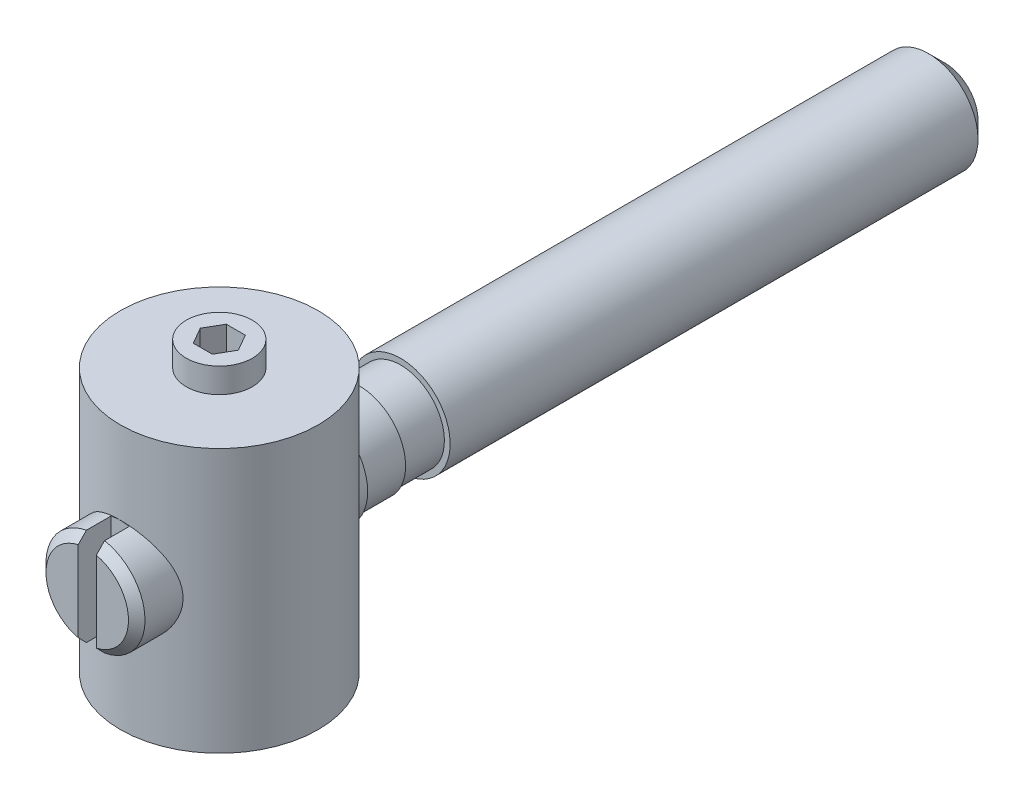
ISO-10303-21;
HEADER;
FILE_DESCRIPTION(('STEP AP214'),'2;1');
FILE_NAME('part.step','',(''),(''),'','','');
FILE_SCHEMA(('AUTOMOTIVE_DESIGN { 1 0 10303 214 1 1 1 1 }'));
ENDSEC;
DATA;
#1=APPLICATION_CONTEXT('core data for automotive mechanical design processes');
#2=APPLICATION_PROTOCOL_DEFINITION('international standard','automotive_design',2000,#1);
#3=PRODUCT_CONTEXT('',#1,'mechanical');
#4=PRODUCT('Part','Part','',(#3));
#5=PRODUCT_RELATED_PRODUCT_CATEGORY('part','',(#4));
#6=PRODUCT_DEFINITION_FORMATION('','',#4);
#7=PRODUCT_DEFINITION_CONTEXT('part definition',#1,'design');
#8=PRODUCT_DEFINITION('design','',#6,#7);
#9=PRODUCT_DEFINITION_SHAPE('','',#8);
#10=(LENGTH_UNIT() NAMED_UNIT(*) SI_UNIT(.MILLI.,.METRE.));
#11=(NAMED_UNIT(*) PLANE_ANGLE_UNIT() SI_UNIT($,.RADIAN.));
#12=(NAMED_UNIT(*) SI_UNIT($,.STERADIAN.) SOLID_ANGLE_UNIT());
#13=UNCERTAINTY_MEASURE_WITH_UNIT(LENGTH_MEASURE(1.E-05),#10,'distance_accuracy_value','');
#14=(GEOMETRIC_REPRESENTATION_CONTEXT(3) GLOBAL_UNCERTAINTY_ASSIGNED_CONTEXT((#13)) GLOBAL_UNIT_ASSIGNED_CONTEXT((#10,
#11,#12)) REPRESENTATION_CONTEXT('',''));
#15=CARTESIAN_POINT('',(0.,0.,0.));
#16=DIRECTION('',(0.,0.,1.));
#17=DIRECTION('',(1.,0.,0.));
#18=AXIS2_PLACEMENT_3D('',#15,#16,#17);
#19=CARTESIAN_POINT('',(0.,0.,8.0051873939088));
#20=DIRECTION('',(0.,0.,-1.));
#21=DIRECTION('',(0.,1.,0.));
#22=AXIS2_PLACEMENT_3D('',#19,#20,#21);
#23=PLANE('',#22);
#24=CARTESIAN_POINT('',(0.,0.,8.0051873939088));
#25=DIRECTION('',(0.,0.,-1.));
#26=DIRECTION('',(0.,1.,0.));
#27=AXIS2_PLACEMENT_3D('',#24,#25,#26);
#28=CIRCLE('',#27,2.5);
#29=CARTESIAN_POINT('',(0.55,-2.43874967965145,8.0051873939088));
#30=VERTEX_POINT('',#29);
#31=CARTESIAN_POINT('',(0.55,2.43874967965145,8.0051873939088));
#32=VERTEX_POINT('',#31);
#33=EDGE_CURVE('E661',#30,#32,#28,.F.);
#34=ORIENTED_EDGE('',*,*,#33,.T.);
#35=DIRECTION('',(0.,1.,0.));
#36=VECTOR('',#35,1.);
#37=CARTESIAN_POINT('',(0.55,2.94915242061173,8.0051873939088));
#38=LINE('',#37,#36);
#39=EDGE_CURVE('E339',#30,#32,#38,.T.);
#40=ORIENTED_EDGE('',*,*,#39,.F.);
#41=EDGE_LOOP('',(#34,#40));
#42=FACE_BOUND('',#41,.T.);
#43=ADVANCED_FACE('F14',(#42),#23,.F.);
#44=CARTESIAN_POINT('',(-0.55,2.43874967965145,8.0051873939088));
#45=VERTEX_POINT('',#44);
#46=CARTESIAN_POINT('',(-0.55,-2.43874967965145,8.0051873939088));
#47=VERTEX_POINT('',#46);
#48=EDGE_CURVE('E657',#45,#47,#28,.F.);
#49=ORIENTED_EDGE('',*,*,#48,.T.);
#50=DIRECTION('',(0.,-1.,0.));
#51=VECTOR('',#50,1.);
#52=CARTESIAN_POINT('',(-0.55,2.94915242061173,8.0051873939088));
#53=LINE('',#52,#51);
#54=EDGE_CURVE('E324',#45,#47,#53,.T.);
#55=ORIENTED_EDGE('',*,*,#54,.F.);
#56=EDGE_LOOP('',(#49,#55));
#57=FACE_BOUND('',#56,.T.);
#58=ADVANCED_FACE('F232',(#57),#23,.F.);
#59=CARTESIAN_POINT('',(0.,0.,8.0051873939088));
#60=DIRECTION('',(0.,0.,-1.));
#61=DIRECTION('',(0.,1.,0.));
#62=AXIS2_PLACEMENT_3D('',#59,#60,#61);
#63=CONICAL_SURFACE('',#62,2.5,0.785398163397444);
#64=CARTESIAN_POINT('',(0.55,-6.50102808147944,3.9809352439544));
#65=CARTESIAN_POINT('',(0.550000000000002,-6.26878430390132,4.21234487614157));
#66=CARTESIAN_POINT('',(0.550000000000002,-6.03650345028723,4.44371734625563));
#67=CARTESIAN_POINT('',(0.550000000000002,-5.57180325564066,4.90634935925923));
#68=CARTESIAN_POINT('',(0.550000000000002,-5.33938390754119,5.13760889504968));
#69=CARTESIAN_POINT('',(0.550000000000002,-4.87405391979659,5.60026316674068));
#70=CARTESIAN_POINT('',(0.550000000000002,-4.64114304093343,5.83165766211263));
#71=CARTESIAN_POINT('',(0.550000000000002,-4.17505880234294,6.29415664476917));
#72=CARTESIAN_POINT('',(0.550000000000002,-3.94188545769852,6.52526114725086));
#73=CARTESIAN_POINT('',(0.550000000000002,-3.48876050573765,6.97348944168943));
#74=CARTESIAN_POINT('',(0.550000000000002,-3.2688345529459,7.19063914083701));
#75=CARTESIAN_POINT('',(0.550000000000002,-2.93838672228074,7.51583248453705));
#76=CARTESIAN_POINT('',(0.550000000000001,-2.82813513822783,7.62415068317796));
#77=CARTESIAN_POINT('',(0.550000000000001,-2.60737712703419,7.84052364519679));
#78=CARTESIAN_POINT('',(0.550000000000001,-2.49687070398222,7.94857841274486));
#79=CARTESIAN_POINT('',(0.550000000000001,-2.27557596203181,8.16422073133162));
#80=CARTESIAN_POINT('',(0.550000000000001,-2.16478794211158,8.27180858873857));
#81=CARTESIAN_POINT('',(0.550000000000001,-1.94263422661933,8.48640006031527));
#82=CARTESIAN_POINT('',(0.550000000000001,-1.83126849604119,8.59340363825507));
#83=CARTESIAN_POINT('',(0.550000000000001,-1.60764395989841,8.80641455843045));
#84=CARTESIAN_POINT('',(0.550000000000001,-1.49538542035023,8.91242217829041));
#85=CARTESIAN_POINT('',(0.550000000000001,-1.32572231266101,9.07005149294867));
#86=CARTESIAN_POINT('',(0.550000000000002,-1.26895825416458,9.12236167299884));
#87=CARTESIAN_POINT('',(0.550000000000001,-1.15481596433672,9.22630662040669));
#88=CARTESIAN_POINT('',(0.55,-1.09743775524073,9.27794141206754));
#89=CARTESIAN_POINT('',(0.55,-1.00730091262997,9.35761177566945));
#90=CARTESIAN_POINT('',(0.550000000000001,-0.974856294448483,9.38600225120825));
#91=CARTESIAN_POINT('',(0.550000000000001,-0.909597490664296,9.44236289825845));
#92=CARTESIAN_POINT('',(0.550000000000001,-0.876783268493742,9.47033302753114));
#93=CARTESIAN_POINT('',(0.550000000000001,-0.810349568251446,9.52598685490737));
#94=CARTESIAN_POINT('',(0.550000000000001,-0.776725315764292,9.55366487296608));
#95=CARTESIAN_POINT('',(0.550000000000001,-0.708843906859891,9.60821974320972));
#96=CARTESIAN_POINT('',(0.55,-0.674586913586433,9.63509679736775));
#97=CARTESIAN_POINT('',(0.55,-0.604824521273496,9.68800399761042));
#98=CARTESIAN_POINT('',(0.550000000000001,-0.569309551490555,9.71402162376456));
#99=CARTESIAN_POINT('',(0.550000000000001,-0.497005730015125,9.76435177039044));
#100=CARTESIAN_POINT('',(0.550000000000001,-0.460215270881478,9.78866201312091));
#101=CARTESIAN_POINT('',(0.550000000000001,-0.385289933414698,9.83431268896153));
#102=CARTESIAN_POINT('',(0.550000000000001,-0.34717164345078,9.85567974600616));
#103=CARTESIAN_POINT('',(0.550000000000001,-0.268817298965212,9.89396414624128));
#104=CARTESIAN_POINT('',(0.55,-0.228588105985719,9.91089495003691));
#105=CARTESIAN_POINT('',(0.55,-0.149262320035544,9.93640009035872));
#106=CARTESIAN_POINT('',(0.550000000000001,-0.110374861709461,9.94557620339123));
#107=CARTESIAN_POINT('',(0.550000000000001,-0.0513606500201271,9.95314112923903));
#108=CARTESIAN_POINT('',(0.550000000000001,-0.0316215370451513,9.95463319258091));
#109=CARTESIAN_POINT('',(0.550000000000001,0.00790124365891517,9.95548587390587));
#110=CARTESIAN_POINT('',(0.55,0.0276849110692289,9.95484650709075));
#111=CARTESIAN_POINT('',(0.55,0.0865984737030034,9.94977291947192));
#112=CARTESIAN_POINT('',(0.550000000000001,0.125485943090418,9.94220777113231));
#113=CARTESIAN_POINT('',(0.550000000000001,0.182445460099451,9.92601337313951));
#114=CARTESIAN_POINT('',(0.550000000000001,0.201280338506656,9.9197704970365));
#115=CARTESIAN_POINT('',(0.55,0.238462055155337,9.90596368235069));
#116=CARTESIAN_POINT('',(0.55,0.256808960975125,9.89839992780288));
#117=CARTESIAN_POINT('',(0.55,0.305948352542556,9.87643510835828));
#118=CARTESIAN_POINT('',(0.55,0.336277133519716,9.86100721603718));
#119=CARTESIAN_POINT('',(0.550000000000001,0.395777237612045,9.82804111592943));
#120=CARTESIAN_POINT('',(0.550000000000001,0.424947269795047,9.81050063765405));
#121=CARTESIAN_POINT('',(0.550000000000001,0.482451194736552,9.77391062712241));
#122=CARTESIAN_POINT('',(0.550000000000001,0.510782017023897,9.75485631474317));
#123=CARTESIAN_POINT('',(0.550000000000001,0.566720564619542,9.71570945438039));
#124=CARTESIAN_POINT('',(0.550000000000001,0.594328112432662,9.69561665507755));
#125=CARTESIAN_POINT('',(0.550000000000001,0.676801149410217,9.63386089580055));
#126=CARTESIAN_POINT('',(0.550000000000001,0.730809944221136,9.59105876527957));
#127=CARTESIAN_POINT('',(0.55,0.837297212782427,9.50386307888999));
#128=CARTESIAN_POINT('',(0.55,0.889778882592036,9.45947335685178));
#129=CARTESIAN_POINT('',(0.55,0.992705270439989,9.37059267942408));
#130=CARTESIAN_POINT('',(0.55,1.04316953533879,9.32612430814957));
#131=CARTESIAN_POINT('',(0.550000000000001,1.14348661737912,9.2365035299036));
#132=CARTESIAN_POINT('',(0.55,1.19333941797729,9.19135110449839));
#133=CARTESIAN_POINT('',(0.55,1.34226503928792,9.05517405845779));
#134=CARTESIAN_POINT('',(0.55,1.44069043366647,8.96344255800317));
#135=CARTESIAN_POINT('',(0.55,1.63669733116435,8.77885702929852));
#136=CARTESIAN_POINT('',(0.55,1.73427769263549,8.68600179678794));
#137=CARTESIAN_POINT('',(0.55,1.92882854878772,8.49967073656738));
#138=CARTESIAN_POINT('',(0.55,2.02579909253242,8.40619496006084));
#139=CARTESIAN_POINT('',(0.55,2.2184603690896,8.21969145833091));
#140=CARTESIAN_POINT('',(0.55,2.31415469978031,8.12666744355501));
#141=CARTESIAN_POINT('',(0.55,2.5052737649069,7.94033898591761));
#142=CARTESIAN_POINT('',(0.55,2.6006984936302,7.84703453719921));
#143=CARTESIAN_POINT('',(0.55,2.88659462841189,7.56691205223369));
#144=CARTESIAN_POINT('',(0.55,3.07677660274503,7.3797987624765));
#145=CARTESIAN_POINT('',(0.55,3.53573885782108,6.92720423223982));
#146=CARTESIAN_POINT('',(0.55,3.80430289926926,6.66150397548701));
#147=CARTESIAN_POINT('',(0.55,4.34102523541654,6.12960257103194));
#148=CARTESIAN_POINT('',(0.55,4.60918345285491,5.8634013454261));
#149=CARTESIAN_POINT('',(0.549999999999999,5.14808057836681,5.3279001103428));
#150=CARTESIAN_POINT('',(0.549999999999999,5.41881663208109,5.05859722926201));
#151=CARTESIAN_POINT('',(0.549999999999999,5.96005951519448,4.51985635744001));
#152=CARTESIAN_POINT('',(0.549999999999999,6.23056637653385,4.25041839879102));
#153=CARTESIAN_POINT('',(0.55,6.50102808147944,3.9809352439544));
#154=B_SPLINE_CURVE_WITH_KNOTS('',3,(#64,#65,#66,#67,#68,#69,#70,#71,#72,#73,#74,#75,#76,#77,
#78,#79,#80,#81,#82,#83,#84,#85,#86,#87,#88,#89,#90,#91,#92,#93,#94,#95,#96,#97,#98,#99,#100,
#101,#102,#103,#104,#105,#106,#107,#108,#109,#110,#111,#112,#113,#114,#115,#116,#117,#118,#119,
#120,#121,#122,#123,#124,#125,#126,#127,#128,#129,#130,#131,#132,#133,#134,#135,#136,#137,#138,
#139,#140,#141,#142,#143,#144,#145,#146,#147,#148,#149,#150,#151,#152,#153),.UNSPECIFIED.,.F.,
.F.,(4,2,2,2,2,2,2,2,2,2,2,2,2,2,2,2,2,2,2,2,2,2,2,2,2,2,2,2,2,2,2,2,2,2,2,2,2,2,2,2,2,2,2,2,4),
(0.,0.98355904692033,1.9671735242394,2.95211904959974,3.93701060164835,4.86420563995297,
5.32787999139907,5.79154695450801,6.25484022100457,6.71816189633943,7.18135034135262,
7.41292148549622,7.64448427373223,7.77381859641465,7.9031658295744,8.03380939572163,
8.16441973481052,8.29646240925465,8.42867801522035,8.55960561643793,8.69013122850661,
8.80923071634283,8.86850869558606,8.92778625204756,9.04576418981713,9.10526044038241,
9.16474840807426,9.26669637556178,9.36875490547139,9.47114958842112,9.57356916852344,
9.78023388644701,9.98642938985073,10.1882031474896,10.3899823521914,10.7935992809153,
11.1976957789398,11.601759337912,12.0021308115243,12.4025107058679,13.2028997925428,
14.3362608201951,15.4698157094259,16.6154152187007,17.7608132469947),.UNSPECIFIED.);
#155=CARTESIAN_POINT('',(0.55,-2.94915242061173,7.5051873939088));
#156=VERTEX_POINT('',#155);
#157=EDGE_CURVE('E254',#156,#30,#154,.T.);
#158=ORIENTED_EDGE('',*,*,#157,.F.);
#159=CARTESIAN_POINT('',(0.,0.,7.5051873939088));
#160=DIRECTION('',(0.,0.,-1.));
#161=DIRECTION('',(0.,1.,0.));
#162=AXIS2_PLACEMENT_3D('',#159,#160,#161);
#163=CIRCLE('',#162,3.);
#164=CARTESIAN_POINT('',(0.55,2.94915242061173,7.5051873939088));
#165=VERTEX_POINT('',#164);
#166=EDGE_CURVE('E663',#165,#156,#163,.T.);
#167=ORIENTED_EDGE('',*,*,#166,.F.);
#168=EDGE_CURVE('E238',#32,#165,#154,.T.);
#169=ORIENTED_EDGE('',*,*,#168,.F.);
#170=ORIENTED_EDGE('',*,*,#33,.F.);
#171=EDGE_LOOP('',(#158,#167,#169,#170));
#172=FACE_BOUND('',#171,.T.);
#173=ADVANCED_FACE('F227',(#172),#63,.T.);
#174=CARTESIAN_POINT('',(0.55,2.94915242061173,6.0051873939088));
#175=DIRECTION('',(1.,0.,0.));
#176=DIRECTION('',(0.,1.,0.));
#177=AXIS2_PLACEMENT_3D('',#174,#175,#176);
#178=PLANE('',#177);
#179=ORIENTED_EDGE('',*,*,#157,.T.);
#180=ORIENTED_EDGE('',*,*,#39,.T.);
#181=ORIENTED_EDGE('',*,*,#168,.T.);
#182=DIRECTION('',(0.,0.,1.));
#183=VECTOR('',#182,1.);
#184=CARTESIAN_POINT('',(0.55,2.94915242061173,6.0051873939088));
#185=LINE('',#184,#183);
#186=CARTESIAN_POINT('',(0.55,2.94915242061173,6.0051873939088));
#187=VERTEX_POINT('',#186);
#188=EDGE_CURVE('E321',#187,#165,#185,.T.);
#189=ORIENTED_EDGE('',*,*,#188,.F.);
#190=DIRECTION('',(0.,1.,0.));
#191=VECTOR('',#190,1.);
#192=CARTESIAN_POINT('',(0.55,2.94915242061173,6.0051873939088));
#193=LINE('',#192,#191);
#194=CARTESIAN_POINT('',(0.55,-2.94915242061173,6.0051873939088));
#195=VERTEX_POINT('',#194);
#196=EDGE_CURVE('E89',#195,#187,#193,.T.);
#197=ORIENTED_EDGE('',*,*,#196,.F.);
#198=DIRECTION('',(0.,0.,1.));
#199=VECTOR('',#198,1.);
#200=CARTESIAN_POINT('',(0.55,-2.94915242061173,6.0051873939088));
#201=LINE('',#200,#199);
#202=EDGE_CURVE('E328',#195,#156,#201,.T.);
#203=ORIENTED_EDGE('',*,*,#202,.T.);
#204=EDGE_LOOP('',(#179,#180,#181,#189,#197,#203));
#205=FACE_BOUND('',#204,.T.);
#206=ADVANCED_FACE('F231',(#205),#178,.F.);
#207=CARTESIAN_POINT('',(0.,0.,6.0051873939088));
#208=DIRECTION('',(0.,0.,1.));
#209=DIRECTION('',(0.,-1.,0.));
#210=AXIS2_PLACEMENT_3D('',#207,#208,#209);
#211=PLANE('',#210);
#212=CARTESIAN_POINT('',(0.,0.,6.0051873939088));
#213=DIRECTION('',(0.,0.,1.));
#214=DIRECTION('',(0.,-1.,0.));
#215=AXIS2_PLACEMENT_3D('',#212,#213,#214);
#216=CIRCLE('',#215,3.);
#217=CARTESIAN_POINT('',(-0.55,-2.94915242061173,6.0051873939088));
#218=VERTEX_POINT('',#217);
#219=EDGE_CURVE('E343',#218,#195,#216,.T.);
#220=ORIENTED_EDGE('',*,*,#219,.T.);
#221=ORIENTED_EDGE('',*,*,#196,.T.);
#222=CARTESIAN_POINT('',(0.,0.,6.0051873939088));
#223=DIRECTION('',(0.,0.,1.));
#224=DIRECTION('',(0.,-1.,0.));
#225=AXIS2_PLACEMENT_3D('',#222,#223,#224);
#226=CIRCLE('',#225,3.);
#227=CARTESIAN_POINT('',(-0.55,2.94915242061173,6.0051873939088));
#228=VERTEX_POINT('',#227);
#229=EDGE_CURVE('E333',#187,#228,#226,.T.);
#230=ORIENTED_EDGE('',*,*,#229,.T.);
#231=DIRECTION('',(0.,-1.,0.));
#232=VECTOR('',#231,1.);
#233=CARTESIAN_POINT('',(-0.55,2.94915242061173,6.0051873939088));
#234=LINE('',#233,#232);
#235=EDGE_CURVE('E329',#228,#218,#234,.T.);
#236=ORIENTED_EDGE('',*,*,#235,.T.);
#237=EDGE_LOOP('',(#220,#221,#230,#236));
#238=FACE_BOUND('',#237,.T.);
#239=ADVANCED_FACE('F264',(#238),#211,.T.);
#240=CARTESIAN_POINT('',(-0.55,2.94915242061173,6.0051873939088));
#241=DIRECTION('',(-1.,0.,0.));
#242=DIRECTION('',(0.,-1.,0.));
#243=AXIS2_PLACEMENT_3D('',#240,#241,#242);
#244=PLANE('',#243);
#245=CARTESIAN_POINT('',(-0.55,6.50102808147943,3.9809352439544));
#246=CARTESIAN_POINT('',(-0.55,6.26878430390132,4.21234487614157));
#247=CARTESIAN_POINT('',(-0.55,6.03650345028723,4.44371734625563));
#248=CARTESIAN_POINT('',(-0.55,5.57180325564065,4.90634935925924));
#249=CARTESIAN_POINT('',(-0.55,5.33938390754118,5.13760889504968));
#250=CARTESIAN_POINT('',(-0.55,4.87405391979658,5.60026316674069));
#251=CARTESIAN_POINT('',(-0.55,4.64114304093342,5.83165766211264));
#252=CARTESIAN_POINT('',(-0.55,4.17505880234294,6.29415664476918));
#253=CARTESIAN_POINT('',(-0.55,3.94188545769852,6.52526114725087));
#254=CARTESIAN_POINT('',(-0.55,3.48876050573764,6.97348944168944));
#255=CARTESIAN_POINT('',(-0.55,3.26883455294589,7.19063914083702));
#256=CARTESIAN_POINT('',(-0.55,2.93838672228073,7.51583248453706));
#257=CARTESIAN_POINT('',(-0.55,2.82813513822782,7.62415068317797));
#258=CARTESIAN_POINT('',(-0.55,2.60737712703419,7.84052364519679));
#259=CARTESIAN_POINT('',(-0.55,2.49687070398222,7.94857841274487));
#260=CARTESIAN_POINT('',(-0.55,2.27557596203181,8.16422073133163));
#261=CARTESIAN_POINT('',(-0.55,2.16478794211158,8.27180858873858));
#262=CARTESIAN_POINT('',(-0.55,1.94263422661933,8.48640006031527));
#263=CARTESIAN_POINT('',(-0.55,1.83126849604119,8.59340363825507));
#264=CARTESIAN_POINT('',(-0.55,1.60764395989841,8.80641455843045));
#265=CARTESIAN_POINT('',(-0.55,1.49538542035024,8.91242217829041));
#266=CARTESIAN_POINT('',(-0.55,1.32572231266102,9.07005149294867));
#267=CARTESIAN_POINT('',(-0.55,1.26895825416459,9.12236167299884));
#268=CARTESIAN_POINT('',(-0.55,1.15481596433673,9.22630662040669));
#269=CARTESIAN_POINT('',(-0.55,1.09743775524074,9.27794141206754));
#270=CARTESIAN_POINT('',(-0.55,1.00730091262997,9.35761177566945));
#271=CARTESIAN_POINT('',(-0.55,0.974856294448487,9.38600225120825));
#272=CARTESIAN_POINT('',(-0.55,0.9095974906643,9.44236289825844));
#273=CARTESIAN_POINT('',(-0.55,0.876783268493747,9.47033302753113));
#274=CARTESIAN_POINT('',(-0.55,0.81034956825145,9.52598685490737));
#275=CARTESIAN_POINT('',(-0.55,0.776725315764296,9.55366487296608));
#276=CARTESIAN_POINT('',(-0.55,0.708843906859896,9.60821974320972));
#277=CARTESIAN_POINT('',(-0.55,0.674586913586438,9.63509679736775));
#278=CARTESIAN_POINT('',(-0.55,0.6048245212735,9.68800399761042));
#279=CARTESIAN_POINT('',(-0.55,0.569309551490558,9.71402162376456));
#280=CARTESIAN_POINT('',(-0.55,0.497005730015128,9.76435177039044));
#281=CARTESIAN_POINT('',(-0.55,0.460215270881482,9.78866201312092));
#282=CARTESIAN_POINT('',(-0.55,0.385289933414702,9.83431268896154));
#283=CARTESIAN_POINT('',(-0.55,0.347171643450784,9.85567974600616));
#284=CARTESIAN_POINT('',(-0.55,0.268817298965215,9.89396414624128));
#285=CARTESIAN_POINT('',(-0.55,0.228588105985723,9.91089495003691));
#286=CARTESIAN_POINT('',(-0.55,0.149262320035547,9.93640009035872));
#287=CARTESIAN_POINT('',(-0.55,0.110374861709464,9.94557620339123));
#288=CARTESIAN_POINT('',(-0.55,0.0513606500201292,9.95314112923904));
#289=CARTESIAN_POINT('',(-0.55,0.0316215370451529,9.95463319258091));
#290=CARTESIAN_POINT('',(-0.55,-0.00790124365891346,9.95548587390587));
#291=CARTESIAN_POINT('',(-0.55,-0.0276849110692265,9.95484650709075));
#292=CARTESIAN_POINT('',(-0.55,-0.0865984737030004,9.94977291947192));
#293=CARTESIAN_POINT('',(-0.55,-0.125485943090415,9.94220777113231));
#294=CARTESIAN_POINT('',(-0.55,-0.182445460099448,9.92601337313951));
#295=CARTESIAN_POINT('',(-0.55,-0.201280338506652,9.91977049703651));
#296=CARTESIAN_POINT('',(-0.55,-0.238462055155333,9.90596368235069));
#297=CARTESIAN_POINT('',(-0.55,-0.256808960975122,9.89839992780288));
#298=CARTESIAN_POINT('',(-0.55,-0.305948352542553,9.87643510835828));
#299=CARTESIAN_POINT('',(-0.55,-0.336277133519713,9.86100721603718));
#300=CARTESIAN_POINT('',(-0.55,-0.395777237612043,9.82804111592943));
#301=CARTESIAN_POINT('',(-0.55,-0.424947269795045,9.81050063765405));
#302=CARTESIAN_POINT('',(-0.55,-0.48245119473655,9.77391062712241));
#303=CARTESIAN_POINT('',(-0.55,-0.510782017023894,9.75485631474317));
#304=CARTESIAN_POINT('',(-0.55,-0.566720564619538,9.7157094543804));
#305=CARTESIAN_POINT('',(-0.55,-0.59432811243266,9.69561665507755));
#306=CARTESIAN_POINT('',(-0.55,-0.676801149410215,9.63386089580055));
#307=CARTESIAN_POINT('',(-0.55,-0.730809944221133,9.59105876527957));
#308=CARTESIAN_POINT('',(-0.55,-0.837297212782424,9.50386307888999));
#309=CARTESIAN_POINT('',(-0.55,-0.889778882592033,9.45947335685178));
#310=CARTESIAN_POINT('',(-0.55,-0.992705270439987,9.37059267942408));
#311=CARTESIAN_POINT('',(-0.55,-1.04316953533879,9.32612430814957));
#312=CARTESIAN_POINT('',(-0.55,-1.14348661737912,9.2365035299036));
#313=CARTESIAN_POINT('',(-0.55,-1.19333941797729,9.19135110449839));
#314=CARTESIAN_POINT('',(-0.55,-1.34226503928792,9.05517405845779));
#315=CARTESIAN_POINT('',(-0.55,-1.44069043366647,8.96344255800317));
#316=CARTESIAN_POINT('',(-0.55,-1.63669733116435,8.77885702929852));
#317=CARTESIAN_POINT('',(-0.55,-1.73427769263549,8.68600179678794));
#318=CARTESIAN_POINT('',(-0.55,-1.92882854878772,8.49967073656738));
#319=CARTESIAN_POINT('',(-0.55,-2.02579909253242,8.40619496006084));
#320=CARTESIAN_POINT('',(-0.55,-2.2184603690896,8.21969145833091));
#321=CARTESIAN_POINT('',(-0.55,-2.31415469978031,8.12666744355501));
#322=CARTESIAN_POINT('',(-0.55,-2.5052737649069,7.94033898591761));
#323=CARTESIAN_POINT('',(-0.55,-2.6006984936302,7.84703453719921));
#324=CARTESIAN_POINT('',(-0.55,-2.88659462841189,7.56691205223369));
#325=CARTESIAN_POINT('',(-0.55,-3.07677660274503,7.3797987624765));
#326=CARTESIAN_POINT('',(-0.55,-3.53573885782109,6.92720423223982));
#327=CARTESIAN_POINT('',(-0.55,-3.80430289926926,6.66150397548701));
#328=CARTESIAN_POINT('',(-0.55,-4.34102523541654,6.12960257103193));
#329=CARTESIAN_POINT('',(-0.55,-4.60918345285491,5.86340134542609));
#330=CARTESIAN_POINT('',(-0.55,-5.14808057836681,5.3279001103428));
#331=CARTESIAN_POINT('',(-0.55,-5.41881663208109,5.05859722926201));
#332=CARTESIAN_POINT('',(-0.55,-5.96005951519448,4.51985635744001));
#333=CARTESIAN_POINT('',(-0.55,-6.23056637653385,4.25041839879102));
#334=CARTESIAN_POINT('',(-0.55,-6.50102808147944,3.9809352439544));
#335=B_SPLINE_CURVE_WITH_KNOTS('',3,(#245,#246,#247,#248,#249,#250,#251,#252,#253,#254,#255,
#256,#257,#258,#259,#260,#261,#262,#263,#264,#265,#266,#267,#268,#269,#270,#271,#272,#273,#274,
#275,#276,#277,#278,#279,#280,#281,#282,#283,#284,#285,#286,#287,#288,#289,#290,#291,#292,#293,
#294,#295,#296,#297,#298,#299,#300,#301,#302,#303,#304,#305,#306,#307,#308,#309,#310,#311,#312,
#313,#314,#315,#316,#317,#318,#319,#320,#321,#322,#323,#324,#325,#326,#327,#328,#329,#330,#331,
#332,#333,#334),.UNSPECIFIED.,.F.,.F.,(4,2,2,2,2,2,2,2,2,2,2,2,2,2,2,2,2,2,2,2,2,2,2,2,2,2,2,2,
2,2,2,2,2,2,2,2,2,2,2,2,2,2,2,2,4),(0.,0.983559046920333,1.96717352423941,2.95211904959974,
3.93701060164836,4.86420563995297,5.32787999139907,5.79154695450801,6.25484022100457,
6.71816189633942,7.18135034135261,7.41292148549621,7.64448427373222,7.77381859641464,
7.90316582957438,8.03380939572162,8.1644197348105,8.29646240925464,8.42867801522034,
8.55960561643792,8.6901312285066,8.80923071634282,8.86850869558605,8.92778625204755,
9.04576418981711,9.1052604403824,9.16474840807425,9.26669637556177,9.36875490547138,
9.47114958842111,9.57356916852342,9.780233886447,9.98642938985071,10.1882031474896,
10.3899823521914,10.7935992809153,11.1976957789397,11.601759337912,12.0021308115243,
12.4025107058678,13.2028997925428,14.3362608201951,15.4698157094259,16.6154152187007,
17.7608132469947),.UNSPECIFIED.);
#336=CARTESIAN_POINT('',(-0.55,2.94915242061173,7.5051873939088));
#337=VERTEX_POINT('',#336);
#338=EDGE_CURVE('E253',#337,#45,#335,.T.);
#339=ORIENTED_EDGE('',*,*,#338,.T.);
#340=ORIENTED_EDGE('',*,*,#54,.T.);
#341=CARTESIAN_POINT('',(-0.55,-2.94915242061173,7.5051873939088));
#342=VERTEX_POINT('',#341);
#343=EDGE_CURVE('E246',#47,#342,#335,.T.);
#344=ORIENTED_EDGE('',*,*,#343,.T.);
#345=DIRECTION('',(0.,0.,1.));
#346=VECTOR('',#345,1.);
#347=CARTESIAN_POINT('',(-0.55,-2.94915242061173,6.0051873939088));
#348=LINE('',#347,#346);
#349=EDGE_CURVE('E311',#218,#342,#348,.T.);
#350=ORIENTED_EDGE('',*,*,#349,.F.);
#351=ORIENTED_EDGE('',*,*,#235,.F.);
#352=DIRECTION('',(0.,0.,1.));
#353=VECTOR('',#352,1.);
#354=CARTESIAN_POINT('',(-0.55,2.94915242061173,6.0051873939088));
#355=LINE('',#354,#353);
#356=EDGE_CURVE('E315',#228,#337,#355,.T.);
#357=ORIENTED_EDGE('',*,*,#356,.T.);
#358=EDGE_LOOP('',(#339,#340,#344,#350,#351,#357));
#359=FACE_BOUND('',#358,.T.);
#360=ADVANCED_FACE('F260',(#359),#244,.F.);
#361=ORIENTED_EDGE('',*,*,#338,.F.);
#362=EDGE_CURVE('E660',#342,#337,#163,.T.);
#363=ORIENTED_EDGE('',*,*,#362,.F.);
#364=ORIENTED_EDGE('',*,*,#343,.F.);
#365=ORIENTED_EDGE('',*,*,#48,.F.);
#366=EDGE_LOOP('',(#361,#363,#364,#365));
#367=FACE_BOUND('',#366,.T.);
#368=ADVANCED_FACE('F234',(#367),#63,.T.);
#369=CARTESIAN_POINT('',(0.,0.,38.3005533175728));
#370=DIRECTION('',(0.,0.,1.));
#371=DIRECTION('',(0.,-1.,0.));
#372=AXIS2_PLACEMENT_3D('',#369,#370,#371);
#373=CYLINDRICAL_SURFACE('',#372,3.);
#374=ORIENTED_EDGE('',*,*,#362,.T.);
#375=ORIENTED_EDGE('',*,*,#356,.F.);
#376=ORIENTED_EDGE('',*,*,#229,.F.);
#377=ORIENTED_EDGE('',*,*,#188,.T.);
#378=ORIENTED_EDGE('',*,*,#166,.T.);
#379=ORIENTED_EDGE('',*,*,#202,.F.);
#380=ORIENTED_EDGE('',*,*,#219,.F.);
#381=ORIENTED_EDGE('',*,*,#349,.T.);
#382=EDGE_LOOP('',(#374,#375,#376,#377,#378,#379,#380,#381));
#383=FACE_BOUND('',#382,.T.);
#384=CARTESIAN_POINT('',(0.,-3.,6.));
#385=CARTESIAN_POINT('',(-0.0788941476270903,-2.99999916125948,5.99999934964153));
#386=CARTESIAN_POINT('',(-0.15779662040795,-2.99688205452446,5.99843869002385));
#387=CARTESIAN_POINT('',(-0.315001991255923,-2.98446072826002,5.99224358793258));
#388=CARTESIAN_POINT('',(-0.393304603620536,-2.97515372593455,5.98760776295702));
#389=CARTESIAN_POINT('',(-0.626628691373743,-2.93804214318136,5.96921978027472));
#390=CARTESIAN_POINT('',(-0.77995289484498,-2.90104717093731,5.95098734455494));
#391=CARTESIAN_POINT('',(-1.07683586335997,-2.80441822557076,5.90448966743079));
#392=CARTESIAN_POINT('',(-1.22043005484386,-2.74487223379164,5.87626344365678));
#393=CARTESIAN_POINT('',(-1.49540820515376,-2.60528874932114,5.81237302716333));
#394=CARTESIAN_POINT('',(-1.62679312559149,-2.52525287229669,5.77670942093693));
#395=CARTESIAN_POINT('',(-1.88252701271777,-2.34144601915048,5.6986875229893));
#396=CARTESIAN_POINT('',(-2.0059694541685,-2.23653205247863,5.65605474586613));
#397=CARTESIAN_POINT('',(-2.23433451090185,-2.00844407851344,5.5698003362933));
#398=CARTESIAN_POINT('',(-2.3392430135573,-1.88525628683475,5.52617797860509));
#399=CARTESIAN_POINT('',(-2.53576864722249,-1.61251563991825,5.43896347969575));
#400=CARTESIAN_POINT('',(-2.62572411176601,-1.46165902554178,5.39563602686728));
#401=CARTESIAN_POINT('',(-2.7403403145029,-1.22404914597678,5.33782449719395));
#402=CARTESIAN_POINT('',(-2.77516786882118,-1.14292907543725,5.31974570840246));
#403=CARTESIAN_POINT('',(-2.83769299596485,-0.977399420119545,5.28665768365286));
#404=CARTESIAN_POINT('',(-2.86539478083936,-0.892991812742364,5.27164663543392));
#405=CARTESIAN_POINT('',(-2.91188280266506,-0.726604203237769,5.24610341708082));
#406=CARTESIAN_POINT('',(-2.93110042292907,-0.644777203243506,5.23535838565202));
#407=CARTESIAN_POINT('',(-2.9626355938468,-0.479445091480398,5.21757784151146));
#408=CARTESIAN_POINT('',(-2.97495680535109,-0.395940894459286,5.21054036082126));
#409=CARTESIAN_POINT('',(-2.99251382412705,-0.227993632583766,5.20047756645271));
#410=CARTESIAN_POINT('',(-2.99775389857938,-0.143551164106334,5.19744983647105));
#411=CARTESIAN_POINT('',(-3.00108452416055,0.0254936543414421,5.19552555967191));
#412=CARTESIAN_POINT('',(-2.99917575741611,0.110095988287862,5.19662861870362));
#413=CARTESIAN_POINT('',(-2.98404973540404,0.342753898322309,5.20534668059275));
#414=CARTESIAN_POINT('',(-2.96335042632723,0.490244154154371,5.21726794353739));
#415=CARTESIAN_POINT('',(-2.90082280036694,0.77919367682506,5.25228182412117));
#416=CARTESIAN_POINT('',(-2.85898775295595,0.920651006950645,5.27537800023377));
#417=CARTESIAN_POINT('',(-2.75462843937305,1.19767965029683,5.33062568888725));
#418=CARTESIAN_POINT('',(-2.69164495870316,1.33303711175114,5.36297559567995));
#419=CARTESIAN_POINT('',(-2.54712530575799,1.59190496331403,5.43310175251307));
#420=CARTESIAN_POINT('',(-2.46558080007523,1.71540999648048,5.47088043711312));
#421=CARTESIAN_POINT('',(-2.27419808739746,1.96356309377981,5.55339485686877));
#422=CARTESIAN_POINT('',(-2.16208335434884,2.0863704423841,5.59840533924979));
#423=CARTESIAN_POINT('',(-1.91866675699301,2.31220643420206,5.68642866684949));
#424=CARTESIAN_POINT('',(-1.78735577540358,2.41522562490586,5.72944054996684));
#425=CARTESIAN_POINT('',(-1.50154951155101,2.60305693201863,5.8110596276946));
#426=CARTESIAN_POINT('',(-1.3462607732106,2.68680140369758,5.84936952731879));
#427=CARTESIAN_POINT('',(-1.02139864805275,2.82629110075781,5.91473643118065));
#428=CARTESIAN_POINT('',(-0.851836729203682,2.88205855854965,5.94180236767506));
#429=CARTESIAN_POINT('',(-0.518299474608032,2.95942620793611,5.97973001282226));
#430=CARTESIAN_POINT('',(-0.355024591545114,2.98347370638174,5.99174814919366));
#431=CARTESIAN_POINT('',(-0.0263387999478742,3.00439419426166,6.00219040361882));
#432=CARTESIAN_POINT('',(0.139071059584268,3.00128005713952,6.0006209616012));
#433=CARTESIAN_POINT('',(0.453698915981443,2.96937993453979,5.98473576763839));
#434=CARTESIAN_POINT('',(0.603178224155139,2.94260240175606,5.97141737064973));
#435=CARTESIAN_POINT('',(0.895220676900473,2.86728578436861,5.93466513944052));
#436=CARTESIAN_POINT('',(1.03778305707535,2.81874430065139,5.91123019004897));
#437=CARTESIAN_POINT('',(1.31666582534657,2.7000046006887,5.85552754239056));
#438=CARTESIAN_POINT('',(1.45269119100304,2.62922684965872,5.82302645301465));
#439=CARTESIAN_POINT('',(1.71138408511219,2.46867739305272,5.75231922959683));
#440=CARTESIAN_POINT('',(1.83404588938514,2.37889759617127,5.71411066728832));
#441=CARTESIAN_POINT('',(2.07530306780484,2.17271872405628,5.63124663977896));
#442=CARTESIAN_POINT('',(2.19231623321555,2.05457139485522,5.58632654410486));
#443=CARTESIAN_POINT('',(2.40556896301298,1.8002245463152,5.49787174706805));
#444=CARTESIAN_POINT('',(2.50179415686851,1.66401264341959,5.45433802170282));
#445=CARTESIAN_POINT('',(2.675123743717,1.36906903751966,5.37153576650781));
#446=CARTESIAN_POINT('',(2.75107648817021,1.20956620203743,5.33257588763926));
#447=CARTESIAN_POINT('',(2.87424847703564,0.877469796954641,5.26722216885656));
#448=CARTESIAN_POINT('',(2.92150474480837,0.704893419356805,5.2408121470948));
#449=CARTESIAN_POINT('',(2.98158506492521,0.369269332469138,5.20684503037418));
#450=CARTESIAN_POINT('',(2.997278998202,0.206897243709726,5.19772150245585));
#451=CARTESIAN_POINT('',(3.00206745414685,-0.118341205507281,5.19496064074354));
#452=CARTESIAN_POINT('',(2.99117350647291,-0.281207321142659,5.20131659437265));
#453=CARTESIAN_POINT('',(2.94577840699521,-0.586450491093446,5.22713585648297));
#454=CARTESIAN_POINT('',(2.91362505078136,-0.729301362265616,5.24529281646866));
#455=CARTESIAN_POINT('',(2.82952596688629,-1.0074244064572,5.29113050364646));
#456=CARTESIAN_POINT('',(2.77757387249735,-1.14269412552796,5.31881429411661));
#457=CARTESIAN_POINT('',(2.65144766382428,-1.41187436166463,5.38285583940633));
#458=CARTESIAN_POINT('',(2.57601505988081,-1.54508296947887,5.41967139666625));
#459=CARTESIAN_POINT('',(2.40645126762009,-1.7978243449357,5.49706022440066));
#460=CARTESIAN_POINT('',(2.31231035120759,-1.9173499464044,5.5376354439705));
#461=CARTESIAN_POINT('',(2.094616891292,-2.15442285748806,5.62386853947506));
#462=CARTESIAN_POINT('',(1.96888052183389,-2.26996512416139,5.66954494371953));
#463=CARTESIAN_POINT('',(1.69843715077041,-2.47880114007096,5.75633712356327));
#464=CARTESIAN_POINT('',(1.55371998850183,-2.57208289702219,5.79745043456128));
#465=CARTESIAN_POINT('',(1.32452333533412,-2.69317818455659,5.85251406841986));
#466=CARTESIAN_POINT('',(1.24575314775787,-2.73052020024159,5.86982524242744));
#467=CARTESIAN_POINT('',(1.08479725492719,-2.79836167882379,5.90168845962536));
#468=CARTESIAN_POINT('',(1.00261324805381,-2.82886449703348,5.91624185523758));
#469=CARTESIAN_POINT('',(0.835616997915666,-2.88260725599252,5.94212690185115));
#470=CARTESIAN_POINT('',(0.750810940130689,-2.90586304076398,5.95346557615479));
#471=CARTESIAN_POINT('',(0.579142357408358,-2.94488257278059,5.97260771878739));
#472=CARTESIAN_POINT('',(0.492281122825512,-2.96065089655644,5.9804133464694));
#473=CARTESIAN_POINT('',(0.337824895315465,-2.98168467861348,5.99085829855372));
#474=CARTESIAN_POINT('',(0.270495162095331,-2.98854691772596,5.99428035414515));
#475=CARTESIAN_POINT('',(0.135445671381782,-2.99770500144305,5.99885151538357));
#476=CARTESIAN_POINT('',(0.0677259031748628,-3.00000072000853,6.00000055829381));
#477=CARTESIAN_POINT('',(0.,-3.,6.));
#478=B_SPLINE_CURVE_WITH_KNOTS('',3,(#384,#385,#386,#387,#388,#389,#390,#391,#392,#393,#394,
#395,#396,#397,#398,#399,#400,#401,#402,#403,#404,#405,#406,#407,#408,#409,#410,#411,#412,#413,
#414,#415,#416,#417,#418,#419,#420,#421,#422,#423,#424,#425,#426,#427,#428,#429,#430,#431,#432,
#433,#434,#435,#436,#437,#438,#439,#440,#441,#442,#443,#444,#445,#446,#447,#448,#449,#450,#451,
#452,#453,#454,#455,#456,#457,#458,#459,#460,#461,#462,#463,#464,#465,#466,#467,#468,#469,#470,
#471,#472,#473,#474,#475,#476,#477),.UNSPECIFIED.,.T.,.F.,(4,2,2,2,2,2,2,2,2,2,2,2,2,2,2,2,2,2,
2,2,2,2,2,2,2,2,2,2,2,2,2,2,2,2,2,2,2,2,2,2,2,2,2,2,2,2,4),(0.,0.236611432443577,
0.473329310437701,0.947100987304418,1.41904300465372,1.89094781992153,2.39140181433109,
2.89223525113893,3.43190833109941,3.70192714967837,3.97178599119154,4.2256372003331,
4.47935352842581,4.73291689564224,4.98645606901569,5.43238672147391,5.87845946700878,
6.33492255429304,6.79159098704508,7.30616358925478,7.82098138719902,8.35970601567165,
8.89800185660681,9.39171406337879,9.88519228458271,10.3404225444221,10.7957029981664,
11.2640010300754,11.7324988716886,12.2470036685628,12.7618630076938,13.3016558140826,
13.8407507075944,14.3280945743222,14.8152271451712,15.2559532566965,15.6968212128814,
16.1673090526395,16.6380421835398,17.1659726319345,17.6941868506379,17.9605054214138,
18.2266930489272,18.4922945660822,18.7577335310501,18.9608446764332,19.1639614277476),.UNSPECIFIED.);
#479=CARTESIAN_POINT('',(0.,-3.,6.));
#480=VERTEX_POINT('',#479);
#481=EDGE_CURVE('E255',#480,#480,#478,.T.);
#482=ORIENTED_EDGE('',*,*,#481,.F.);
#483=EDGE_LOOP('',(#482));
#484=FACE_BOUND('',#483,.T.);
#485=ADVANCED_FACE('F195',(#383,#484),#373,.T.);
#486=CARTESIAN_POINT('',(-0.577350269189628,8.,-1.));
#487=DIRECTION('',(0.,-1.,0.));
#488=DIRECTION('',(1.,0.,0.));
#489=AXIS2_PLACEMENT_3D('',#486,#487,#488);
#490=PLANE('',#489);
#491=DIRECTION('',(-0.5,0.,0.866025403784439));
#492=VECTOR('',#491,1.);
#493=CARTESIAN_POINT('',(-0.577350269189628,8.,-1.));
#494=LINE('',#493,#492);
#495=CARTESIAN_POINT('',(-0.577350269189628,8.,-1.));
#496=VERTEX_POINT('',#495);
#497=CARTESIAN_POINT('',(-1.15470053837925,8.,0.));
#498=VERTEX_POINT('',#497);
#499=EDGE_CURVE('E388',#496,#498,#494,.T.);
#500=ORIENTED_EDGE('',*,*,#499,.T.);
#501=DIRECTION('',(0.5,0.,0.866025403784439));
#502=VECTOR('',#501,1.);
#503=CARTESIAN_POINT('',(-1.15470053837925,8.,0.));
#504=LINE('',#503,#502);
#505=CARTESIAN_POINT('',(-0.577350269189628,8.,1.));
#506=VERTEX_POINT('',#505);
#507=EDGE_CURVE('E385',#498,#506,#504,.T.);
#508=ORIENTED_EDGE('',*,*,#507,.T.);
#509=DIRECTION('',(1.,0.,0.));
#510=VECTOR('',#509,1.);
#511=CARTESIAN_POINT('',(-0.577350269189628,8.,1.));
#512=LINE('',#511,#510);
#513=CARTESIAN_POINT('',(0.577350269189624,8.,1.));
#514=VERTEX_POINT('',#513);
#515=EDGE_CURVE('E382',#506,#514,#512,.T.);
#516=ORIENTED_EDGE('',*,*,#515,.T.);
#517=DIRECTION('',(0.5,0.,-0.866025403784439));
#518=VECTOR('',#517,1.);
#519=CARTESIAN_POINT('',(0.577350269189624,8.,1.));
#520=LINE('',#519,#518);
#521=CARTESIAN_POINT('',(1.15470053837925,8.,0.));
#522=VERTEX_POINT('',#521);
#523=EDGE_CURVE('E379',#514,#522,#520,.T.);
#524=ORIENTED_EDGE('',*,*,#523,.T.);
#525=DIRECTION('',(-0.5,0.,-0.866025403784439));
#526=VECTOR('',#525,1.);
#527=CARTESIAN_POINT('',(1.15470053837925,8.,0.));
#528=LINE('',#527,#526);
#529=CARTESIAN_POINT('',(0.577350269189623,8.,-1.));
#530=VERTEX_POINT('',#529);
#531=EDGE_CURVE('E376',#522,#530,#528,.T.);
#532=ORIENTED_EDGE('',*,*,#531,.T.);
#533=DIRECTION('',(-1.,0.,0.));
#534=VECTOR('',#533,1.);
#535=CARTESIAN_POINT('',(0.577350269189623,8.,-1.));
#536=LINE('',#535,#534);
#537=EDGE_CURVE('E366',#530,#496,#536,.T.);
#538=ORIENTED_EDGE('',*,*,#537,.T.);
#539=EDGE_LOOP('',(#500,#508,#516,#524,#532,#538));
#540=FACE_BOUND('',#539,.T.);
#541=ADVANCED_FACE('F292',(#540),#490,.F.);
#542=CARTESIAN_POINT('',(-0.577350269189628,8.,1.));
#543=DIRECTION('',(0.,0.,1.));
#544=DIRECTION('',(1.,0.,0.));
#545=AXIS2_PLACEMENT_3D('',#542,#543,#544);
#546=PLANE('',#545);
#547=DIRECTION('',(1.,0.,0.));
#548=VECTOR('',#547,1.);
#549=CARTESIAN_POINT('',(-0.577350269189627,9.5,1.));
#550=LINE('',#549,#548);
#551=CARTESIAN_POINT('',(-0.577350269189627,9.5,1.));
#552=VERTEX_POINT('',#551);
#553=CARTESIAN_POINT('',(0.577350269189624,9.5,1.));
#554=VERTEX_POINT('',#553);
#555=EDGE_CURVE('E399',#552,#554,#550,.T.);
#556=ORIENTED_EDGE('',*,*,#555,.T.);
#557=DIRECTION('',(0.,1.,0.));
#558=VECTOR('',#557,1.);
#559=CARTESIAN_POINT('',(0.577350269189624,8.,1.));
#560=LINE('',#559,#558);
#561=EDGE_CURVE('E74',#514,#554,#560,.T.);
#562=ORIENTED_EDGE('',*,*,#561,.F.);
#563=ORIENTED_EDGE('',*,*,#515,.F.);
#564=DIRECTION('',(0.,1.,0.));
#565=VECTOR('',#564,1.);
#566=CARTESIAN_POINT('',(-0.577350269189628,8.,1.));
#567=LINE('',#566,#565);
#568=EDGE_CURVE('E80',#506,#552,#567,.T.);
#569=ORIENTED_EDGE('',*,*,#568,.T.);
#570=EDGE_LOOP('',(#556,#562,#563,#569));
#571=FACE_BOUND('',#570,.T.);
#572=ADVANCED_FACE('F417',(#571),#546,.F.);
#573=CARTESIAN_POINT('',(0.577350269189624,8.,1.));
#574=DIRECTION('',(0.866025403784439,0.,0.5));
#575=DIRECTION('',(0.5,0.,-0.866025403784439));
#576=AXIS2_PLACEMENT_3D('',#573,#574,#575);
#577=PLANE('',#576);
#578=DIRECTION('',(0.5,0.,-0.866025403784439));
#579=VECTOR('',#578,1.);
#580=CARTESIAN_POINT('',(0.577350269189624,9.5,1.));
#581=LINE('',#580,#579);
#582=CARTESIAN_POINT('',(1.15470053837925,9.5,0.));
#583=VERTEX_POINT('',#582);
#584=EDGE_CURVE('E397',#554,#583,#581,.T.);
#585=ORIENTED_EDGE('',*,*,#584,.T.);
#586=DIRECTION('',(0.,1.,0.));
#587=VECTOR('',#586,1.);
#588=CARTESIAN_POINT('',(1.15470053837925,8.,0.));
#589=LINE('',#588,#587);
#590=EDGE_CURVE('E369',#522,#583,#589,.T.);
#591=ORIENTED_EDGE('',*,*,#590,.F.);
#592=ORIENTED_EDGE('',*,*,#523,.F.);
#593=ORIENTED_EDGE('',*,*,#561,.T.);
#594=EDGE_LOOP('',(#585,#591,#592,#593));
#595=FACE_BOUND('',#594,.T.);
#596=ADVANCED_FACE('F418',(#595),#577,.F.);
#597=CARTESIAN_POINT('',(1.15470053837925,8.,0.));
#598=DIRECTION('',(0.866025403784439,0.,-0.5));
#599=DIRECTION('',(-0.5,0.,-0.866025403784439));
#600=AXIS2_PLACEMENT_3D('',#597,#598,#599);
#601=PLANE('',#600);
#602=DIRECTION('',(-0.5,0.,-0.866025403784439));
#603=VECTOR('',#602,1.);
#604=CARTESIAN_POINT('',(1.15470053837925,9.5,0.));
#605=LINE('',#604,#603);
#606=CARTESIAN_POINT('',(0.577350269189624,9.5,-1.));
#607=VERTEX_POINT('',#606);
#608=EDGE_CURVE('E394',#583,#607,#605,.T.);
#609=ORIENTED_EDGE('',*,*,#608,.T.);
#610=DIRECTION('',(0.,1.,0.));
#611=VECTOR('',#610,1.);
#612=CARTESIAN_POINT('',(0.577350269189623,8.,-1.));
#613=LINE('',#612,#611);
#614=EDGE_CURVE('E371',#530,#607,#613,.T.);
#615=ORIENTED_EDGE('',*,*,#614,.F.);
#616=ORIENTED_EDGE('',*,*,#531,.F.);
#617=ORIENTED_EDGE('',*,*,#590,.T.);
#618=EDGE_LOOP('',(#609,#615,#616,#617));
#619=FACE_BOUND('',#618,.T.);
#620=ADVANCED_FACE('F425',(#619),#601,.F.);
#621=CARTESIAN_POINT('',(0.577350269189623,8.,-1.));
#622=DIRECTION('',(0.,0.,-1.));
#623=DIRECTION('',(-1.,0.,0.));
#624=AXIS2_PLACEMENT_3D('',#621,#622,#623);
#625=PLANE('',#624);
#626=DIRECTION('',(-1.,0.,0.));
#627=VECTOR('',#626,1.);
#628=CARTESIAN_POINT('',(0.577350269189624,9.5,-1.));
#629=LINE('',#628,#627);
#630=CARTESIAN_POINT('',(-0.577350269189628,9.5,-1.));
#631=VERTEX_POINT('',#630);
#632=EDGE_CURVE('E391',#607,#631,#629,.T.);
#633=ORIENTED_EDGE('',*,*,#632,.T.);
#634=DIRECTION('',(0.,1.,0.));
#635=VECTOR('',#634,1.);
#636=CARTESIAN_POINT('',(-0.577350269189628,8.,-1.));
#637=LINE('',#636,#635);
#638=EDGE_CURVE('E362',#496,#631,#637,.T.);
#639=ORIENTED_EDGE('',*,*,#638,.F.);
#640=ORIENTED_EDGE('',*,*,#537,.F.);
#641=ORIENTED_EDGE('',*,*,#614,.T.);
#642=EDGE_LOOP('',(#633,#639,#640,#641));
#643=FACE_BOUND('',#642,.T.);
#644=ADVANCED_FACE('F423',(#643),#625,.F.);
#645=CARTESIAN_POINT('',(-0.577350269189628,8.,-1.));
#646=DIRECTION('',(-0.866025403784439,0.,-0.5));
#647=DIRECTION('',(-0.5,0.,0.866025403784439));
#648=AXIS2_PLACEMENT_3D('',#645,#646,#647);
#649=PLANE('',#648);
#650=DIRECTION('',(-0.5,0.,0.866025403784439));
#651=VECTOR('',#650,1.);
#652=CARTESIAN_POINT('',(-0.577350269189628,9.5,-1.));
#653=LINE('',#652,#651);
#654=CARTESIAN_POINT('',(-1.15470053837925,9.5,0.));
#655=VERTEX_POINT('',#654);
#656=EDGE_CURVE('E350',#631,#655,#653,.T.);
#657=ORIENTED_EDGE('',*,*,#656,.T.);
#658=DIRECTION('',(0.,1.,0.));
#659=VECTOR('',#658,1.);
#660=CARTESIAN_POINT('',(-1.15470053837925,8.,0.));
#661=LINE('',#660,#659);
#662=EDGE_CURVE('E363',#498,#655,#661,.T.);
#663=ORIENTED_EDGE('',*,*,#662,.F.);
#664=ORIENTED_EDGE('',*,*,#499,.F.);
#665=ORIENTED_EDGE('',*,*,#638,.T.);
#666=EDGE_LOOP('',(#657,#663,#664,#665));
#667=FACE_BOUND('',#666,.T.);
#668=ADVANCED_FACE('F404',(#667),#649,.F.);
#669=CARTESIAN_POINT('',(-1.15470053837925,8.,0.));
#670=DIRECTION('',(-0.866025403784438,0.,0.5));
#671=DIRECTION('',(0.5,0.,0.866025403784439));
#672=AXIS2_PLACEMENT_3D('',#669,#670,#671);
#673=PLANE('',#672);
#674=DIRECTION('',(0.5,0.,0.866025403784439));
#675=VECTOR('',#674,1.);
#676=CARTESIAN_POINT('',(-1.15470053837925,9.5,0.));
#677=LINE('',#676,#675);
#678=EDGE_CURVE('E401',#655,#552,#677,.T.);
#679=ORIENTED_EDGE('',*,*,#678,.T.);
#680=ORIENTED_EDGE('',*,*,#568,.F.);
#681=ORIENTED_EDGE('',*,*,#507,.F.);
#682=ORIENTED_EDGE('',*,*,#662,.T.);
#683=EDGE_LOOP('',(#679,#680,#681,#682));
#684=FACE_BOUND('',#683,.T.);
#685=ADVANCED_FACE('F411',(#684),#673,.F.);
#686=CARTESIAN_POINT('',(0.,9.5,0.));
#687=DIRECTION('',(0.,-1.,0.));
#688=DIRECTION('',(1.,0.,0.));
#689=AXIS2_PLACEMENT_3D('',#686,#687,#688);
#690=PLANE('',#689);
#691=ORIENTED_EDGE('',*,*,#678,.F.);
#692=ORIENTED_EDGE('',*,*,#656,.F.);
#693=ORIENTED_EDGE('',*,*,#632,.F.);
#694=ORIENTED_EDGE('',*,*,#608,.F.);
#695=ORIENTED_EDGE('',*,*,#584,.F.);
#696=ORIENTED_EDGE('',*,*,#555,.F.);
#697=EDGE_LOOP('',(#691,#692,#693,#694,#695,#696));
#698=FACE_BOUND('',#697,.T.);
#699=CARTESIAN_POINT('',(0.,9.5,0.));
#700=DIRECTION('',(0.,-1.,0.));
#701=DIRECTION('',(1.,0.,0.));
#702=AXIS2_PLACEMENT_3D('',#699,#700,#701);
#703=CIRCLE('',#702,2.);
#704=CARTESIAN_POINT('',(2.,9.5,0.));
#705=VERTEX_POINT('',#704);
#706=EDGE_CURVE('E359',#705,#705,#703,.T.);
#707=ORIENTED_EDGE('',*,*,#706,.F.);
#708=EDGE_LOOP('',(#707));
#709=FACE_BOUND('',#708,.T.);
#710=ADVANCED_FACE('F413',(#698,#709),#690,.F.);
#711=CARTESIAN_POINT('',(0.,5.5,0.));
#712=DIRECTION('',(0.,-1.,0.));
#713=DIRECTION('',(1.,0.,0.));
#714=AXIS2_PLACEMENT_3D('',#711,#712,#713);
#715=CYLINDRICAL_SURFACE('',#714,2.);
#716=ORIENTED_EDGE('',*,*,#706,.T.);
#717=EDGE_LOOP('',(#716));
#718=FACE_BOUND('',#717,.T.);
#719=CARTESIAN_POINT('',(0.,8.,0.));
#720=DIRECTION('',(0.,-1.,0.));
#721=DIRECTION('',(1.,0.,0.));
#722=AXIS2_PLACEMENT_3D('',#719,#720,#721);
#723=CIRCLE('',#722,2.);
#724=CARTESIAN_POINT('',(2.,8.,0.));
#725=VERTEX_POINT('',#724);
#726=EDGE_CURVE('E356',#725,#725,#723,.T.);
#727=ORIENTED_EDGE('',*,*,#726,.F.);
#728=EDGE_LOOP('',(#727));
#729=FACE_BOUND('',#728,.T.);
#730=ADVANCED_FACE('F530',(#718,#729),#715,.T.);
#731=CARTESIAN_POINT('',(0.,8.,0.));
#732=DIRECTION('',(0.,-1.,0.));
#733=DIRECTION('',(1.,0.,0.));
#734=AXIS2_PLACEMENT_3D('',#731,#732,#733);
#735=PLANE('',#734);
#736=CARTESIAN_POINT('',(0.,8.,0.));
#737=DIRECTION('',(0.,-1.,0.));
#738=DIRECTION('',(1.,0.,0.));
#739=AXIS2_PLACEMENT_3D('',#736,#737,#738);
#740=CIRCLE('',#739,6.);
#741=CARTESIAN_POINT('',(6.,8.,0.));
#742=VERTEX_POINT('',#741);
#743=EDGE_CURVE('E340',#742,#742,#740,.T.);
#744=ORIENTED_EDGE('',*,*,#743,.F.);
#745=EDGE_LOOP('',(#744));
#746=FACE_BOUND('',#745,.T.);
#747=ORIENTED_EDGE('',*,*,#726,.T.);
#748=EDGE_LOOP('',(#747));
#749=FACE_BOUND('',#748,.T.);
#750=ADVANCED_FACE('F16',(#746,#749),#735,.F.);
#751=CARTESIAN_POINT('',(0.,-8.,0.));
#752=DIRECTION('',(0.,-1.,0.));
#753=DIRECTION('',(1.,0.,0.));
#754=AXIS2_PLACEMENT_3D('',#751,#752,#753);
#755=PLANE('',#754);
#756=CARTESIAN_POINT('',(0.,-8.,0.));
#757=DIRECTION('',(0.,-1.,0.));
#758=DIRECTION('',(1.,0.,0.));
#759=AXIS2_PLACEMENT_3D('',#756,#757,#758);
#760=CIRCLE('',#759,6.);
#761=CARTESIAN_POINT('',(6.,-8.,0.));
#762=VERTEX_POINT('',#761);
#763=EDGE_CURVE('E345',#762,#762,#760,.T.);
#764=ORIENTED_EDGE('',*,*,#763,.T.);
#765=EDGE_LOOP('',(#764));
#766=FACE_BOUND('',#765,.T.);
#767=ADVANCED_FACE('F290',(#766),#755,.T.);
#768=CARTESIAN_POINT('',(0.,-8.,0.));
#769=DIRECTION('',(0.,1.,0.));
#770=DIRECTION('',(-1.,0.,0.));
#771=AXIS2_PLACEMENT_3D('',#768,#769,#770);
#772=CYLINDRICAL_SURFACE('',#771,6.);
#773=ORIENTED_EDGE('',*,*,#481,.T.);
#774=EDGE_LOOP('',(#773));
#775=FACE_BOUND('',#774,.T.);
#776=ORIENTED_EDGE('',*,*,#763,.F.);
#777=EDGE_LOOP('',(#776));
#778=FACE_BOUND('',#777,.T.);
#779=ORIENTED_EDGE('',*,*,#743,.T.);
#780=EDGE_LOOP('',(#779));
#781=FACE_BOUND('',#780,.T.);
#782=DIRECTION('',(0.,1.,0.));
#783=VECTOR('',#782,1.);
#784=CARTESIAN_POINT('',(-0.249443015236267,-8.,-5.9948126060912));
#785=LINE('',#784,#783);
#786=CARTESIAN_POINT('',(-0.249443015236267,2.78886682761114,-5.9948126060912));
#787=VERTEX_POINT('',#786);
#788=CARTESIAN_POINT('',(-0.249443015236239,2.98961171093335,-5.9948126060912));
#789=VERTEX_POINT('',#788);
#790=EDGE_CURVE('E171',#787,#789,#785,.T.);
#791=ORIENTED_EDGE('',*,*,#790,.T.);
#792=CARTESIAN_POINT('',(-0.24944301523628,2.98961171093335,-5.9948126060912));
#793=CARTESIAN_POINT('',(-0.330004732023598,2.9829023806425,-5.99147459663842));
#794=CARTESIAN_POINT('',(-0.410210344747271,2.97291932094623,-5.98649676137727));
#795=CARTESIAN_POINT('',(-0.569274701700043,2.94659155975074,-5.97346181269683));
#796=CARTESIAN_POINT('',(-0.64813413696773,2.93025023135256,-5.96540633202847));
#797=CARTESIAN_POINT('',(-0.803591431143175,2.89147571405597,-5.94645720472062));
#798=CARTESIAN_POINT('',(-0.880198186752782,2.86907155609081,-5.93557709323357));
#799=CARTESIAN_POINT('',(-1.03101013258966,2.81839560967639,-5.91124875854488));
#800=CARTESIAN_POINT('',(-1.10521507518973,2.79012321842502,-5.89780027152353));
#801=CARTESIAN_POINT('',(-1.32326188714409,2.69701283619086,-5.85413093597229));
#802=CARTESIAN_POINT('',(-1.46294865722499,2.62377717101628,-5.82053324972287));
#803=CARTESIAN_POINT('',(-1.72813965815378,2.45726165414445,-5.7473946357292));
#804=CARTESIAN_POINT('',(-1.8536262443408,2.36395727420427,-5.70784645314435));
#805=CARTESIAN_POINT('',(-2.09631897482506,2.15246230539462,-5.62343784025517));
#806=CARTESIAN_POINT('',(-2.21235682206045,2.03299902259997,-5.5783991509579));
#807=CARTESIAN_POINT('',(-2.42343129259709,1.77613061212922,-5.49000039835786));
#808=CARTESIAN_POINT('',(-2.51845793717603,1.63871700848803,-5.44664114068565));
#809=CARTESIAN_POINT('',(-2.68891933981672,1.34176609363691,-5.36461418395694));
#810=CARTESIAN_POINT('',(-2.76324651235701,1.18150009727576,-5.32625566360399));
#811=CARTESIAN_POINT('',(-2.88302999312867,0.848170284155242,-5.26239681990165));
#812=CARTESIAN_POINT('',(-2.92852409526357,0.675123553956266,-5.23687967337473));
#813=CARTESIAN_POINT('',(-2.985080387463,0.339566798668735,-5.20482957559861));
#814=CARTESIAN_POINT('',(-2.9991119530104,0.177715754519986,-5.19666371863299));
#815=CARTESIAN_POINT('',(-3.0008049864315,-0.146144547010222,-5.19568908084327));
#816=CARTESIAN_POINT('',(-2.98847637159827,-0.308153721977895,-5.20287452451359));
#817=CARTESIAN_POINT('',(-2.94054735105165,-0.612110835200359,-5.230087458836));
#818=CARTESIAN_POINT('',(-2.90718475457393,-0.754536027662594,-5.24887684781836));
#819=CARTESIAN_POINT('',(-2.82077935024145,-1.03164067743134,-5.29581030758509));
#820=CARTESIAN_POINT('',(-2.76773012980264,-1.16631759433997,-5.32395742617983));
#821=CARTESIAN_POINT('',(-2.63918949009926,-1.4347066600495,-5.3888966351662));
#822=CARTESIAN_POINT('',(-2.56236570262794,-1.56766275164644,-5.42616261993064));
#823=CARTESIAN_POINT('',(-2.38999637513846,-1.81968279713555,-5.50425868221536));
#824=CARTESIAN_POINT('',(-2.29444154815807,-1.93873981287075,-5.54509052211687));
#825=CARTESIAN_POINT('',(-2.07388804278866,-2.17441373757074,-5.63157604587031));
#826=CARTESIAN_POINT('',(-1.94673190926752,-2.28902254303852,-5.67722023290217));
#827=CARTESIAN_POINT('',(-1.67350278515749,-2.49573457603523,-5.76366699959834));
#828=CARTESIAN_POINT('',(-1.5274175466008,-2.58782311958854,-5.80446641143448));
#829=CARTESIAN_POINT('',(-1.29660432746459,-2.70672716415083,-5.85876618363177));
#830=CARTESIAN_POINT('',(-1.21754163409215,-2.7432129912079,-5.87574440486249));
#831=CARTESIAN_POINT('',(-1.0560802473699,-2.80932188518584,-5.90689721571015));
#832=CARTESIAN_POINT('',(-0.973683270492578,-2.8389484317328,-5.92107322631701));
#833=CARTESIAN_POINT('',(-0.806386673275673,-2.89091640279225,-5.94616533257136));
#834=CARTESIAN_POINT('',(-0.721494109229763,-2.91327654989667,-5.9570897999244));
#835=CARTESIAN_POINT('',(-0.549753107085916,-2.95050469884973,-5.97538398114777));
#836=CARTESIAN_POINT('',(-0.4629064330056,-2.96537919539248,-5.98275677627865));
#837=CARTESIAN_POINT('',(-0.354542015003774,-2.97905143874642,-5.98955282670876));
#838=CARTESIAN_POINT('',(-0.333551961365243,-2.98147453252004,-5.99075847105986));
#839=CARTESIAN_POINT('',(-0.291530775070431,-2.98587593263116,-5.99295011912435));
#840=CARTESIAN_POINT('',(-0.270499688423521,-2.9878545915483,-5.99393629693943));
#841=CARTESIAN_POINT('',(-0.24944301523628,-2.98961171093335,-5.9948126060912));
#842=B_SPLINE_CURVE_WITH_KNOTS('',3,(#792,#793,#794,#795,#796,#797,#798,#799,#800,#801,#802,
#803,#804,#805,#806,#807,#808,#809,#810,#811,#812,#813,#814,#815,#816,#817,#818,#819,#820,#821,
#822,#823,#824,#825,#826,#827,#828,#829,#830,#831,#832,#833,#834,#835,#836,#837,#838,#839,#840,
#841),.UNSPECIFIED.,.F.,.F.,(4,2,2,2,2,2,2,2,2,2,2,2,2,2,2,2,2,2,2,2,2,2,2,2,4),(0.,
0.242622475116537,0.485116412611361,0.726469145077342,0.96784668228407,1.44933017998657,
1.93140553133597,2.44673475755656,2.96230820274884,3.50169408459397,4.04037147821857,
4.52558194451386,5.0106098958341,5.45115857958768,5.89185089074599,6.36402161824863,
6.83642704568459,7.3655343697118,7.89498577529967,8.16082401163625,8.42652709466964,
8.69154003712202,8.95632265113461,9.01981077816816,9.08324835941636),.UNSPECIFIED.);
#843=CARTESIAN_POINT('',(-0.249443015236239,-2.98961171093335,-5.9948126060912));
#844=VERTEX_POINT('',#843);
#845=EDGE_CURVE('E282',#789,#844,#842,.T.);
#846=ORIENTED_EDGE('',*,*,#845,.T.);
#847=CARTESIAN_POINT('',(-0.249443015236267,-2.78886682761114,-5.9948126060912));
#848=VERTEX_POINT('',#847);
#849=EDGE_CURVE('E33',#844,#848,#785,.T.);
#850=ORIENTED_EDGE('',*,*,#849,.T.);
#851=CARTESIAN_POINT('',(-0.249443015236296,-2.78886682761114,-5.99481260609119));
#852=CARTESIAN_POINT('',(-0.228686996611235,-2.79072345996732,-5.99567634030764));
#853=CARTESIAN_POINT('',(-0.207905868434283,-2.79234976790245,-5.99643297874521));
#854=CARTESIAN_POINT('',(-0.166336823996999,-2.79513715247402,-5.99772986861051));
#855=CARTESIAN_POINT('',(-0.145548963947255,-2.79629891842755,-5.99827044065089));
#856=CARTESIAN_POINT('',(-0.103968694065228,-2.79815725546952,-5.99913515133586));
#857=CARTESIAN_POINT('',(-0.0831763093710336,-2.79885428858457,-5.99945950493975));
#858=CARTESIAN_POINT('',(-0.0415892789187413,-2.79978344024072,-5.99989187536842));
#859=CARTESIAN_POINT('',(-0.0207946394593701,-2.80001579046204,-6.));
#860=CARTESIAN_POINT('',(0.0207946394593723,-2.80001579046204,-6.));
#861=CARTESIAN_POINT('',(0.0415892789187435,-2.79978344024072,-5.99989187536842));
#862=CARTESIAN_POINT('',(0.0831763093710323,-2.79885428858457,-5.99945950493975));
#863=CARTESIAN_POINT('',(0.103968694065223,-2.79815725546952,-5.99913515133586));
#864=CARTESIAN_POINT('',(0.145548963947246,-2.79629891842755,-5.99827044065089));
#865=CARTESIAN_POINT('',(0.166336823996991,-2.79513715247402,-5.99772986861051));
#866=CARTESIAN_POINT('',(0.207905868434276,-2.79234976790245,-5.99643297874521));
#867=CARTESIAN_POINT('',(0.22868699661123,-2.79072345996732,-5.99567634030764));
#868=CARTESIAN_POINT('',(0.249443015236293,-2.78886682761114,-5.99481260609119));
#869=B_SPLINE_CURVE_WITH_KNOTS('',3,(#851,#852,#853,#854,#855,#856,#857,#858,#859,#860,#861,
#862,#863,#864,#865,#866,#867,#868),.UNSPECIFIED.,.F.,.F.,(4,2,2,2,2,2,2,2,4),(0.,
0.062568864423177,0.125044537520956,0.187458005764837,0.249840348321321,0.312222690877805,
0.374636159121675,0.437111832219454,0.499680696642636),.UNSPECIFIED.);
#870=CARTESIAN_POINT('',(0.249443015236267,-2.78886682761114,-5.9948126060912));
#871=VERTEX_POINT('',#870);
#872=EDGE_CURVE('E9',#848,#871,#869,.T.);
#873=ORIENTED_EDGE('',*,*,#872,.T.);
#874=DIRECTION('',(0.,1.,0.));
#875=VECTOR('',#874,1.);
#876=CARTESIAN_POINT('',(0.249443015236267,-8.,-5.9948126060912));
#877=LINE('',#876,#875);
#878=CARTESIAN_POINT('',(0.249443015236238,-2.98961171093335,-5.9948126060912));
#879=VERTEX_POINT('',#878);
#880=EDGE_CURVE('E147',#871,#879,#877,.F.);
#881=ORIENTED_EDGE('',*,*,#880,.T.);
#882=CARTESIAN_POINT('',(0.24944301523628,-2.98961171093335,-5.9948126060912));
#883=CARTESIAN_POINT('',(0.330004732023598,-2.9829023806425,-5.99147459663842));
#884=CARTESIAN_POINT('',(0.41021034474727,-2.97291932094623,-5.98649676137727));
#885=CARTESIAN_POINT('',(0.569274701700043,-2.94659155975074,-5.97346181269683));
#886=CARTESIAN_POINT('',(0.64813413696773,-2.93025023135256,-5.96540633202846));
#887=CARTESIAN_POINT('',(0.803591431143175,-2.89147571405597,-5.94645720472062));
#888=CARTESIAN_POINT('',(0.880198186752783,-2.86907155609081,-5.93557709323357));
#889=CARTESIAN_POINT('',(1.03101013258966,-2.81839560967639,-5.91124875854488));
#890=CARTESIAN_POINT('',(1.10521507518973,-2.79012321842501,-5.89780027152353));
#891=CARTESIAN_POINT('',(1.32326188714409,-2.69701283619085,-5.8541309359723));
#892=CARTESIAN_POINT('',(1.46294865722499,-2.62377717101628,-5.82053324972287));
#893=CARTESIAN_POINT('',(1.72813965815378,-2.45726165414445,-5.7473946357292));
#894=CARTESIAN_POINT('',(1.8536262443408,-2.36395727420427,-5.70784645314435));
#895=CARTESIAN_POINT('',(2.09631897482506,-2.15246230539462,-5.62343784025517));
#896=CARTESIAN_POINT('',(2.21235682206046,-2.03299902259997,-5.5783991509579));
#897=CARTESIAN_POINT('',(2.42343129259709,-1.77613061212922,-5.49000039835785));
#898=CARTESIAN_POINT('',(2.51845793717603,-1.63871700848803,-5.44664114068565));
#899=CARTESIAN_POINT('',(2.68891933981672,-1.3417660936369,-5.36461418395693));
#900=CARTESIAN_POINT('',(2.76324651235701,-1.18150009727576,-5.32625566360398));
#901=CARTESIAN_POINT('',(2.88302999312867,-0.848170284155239,-5.26239681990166));
#902=CARTESIAN_POINT('',(2.92852409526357,-0.675123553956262,-5.23687967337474));
#903=CARTESIAN_POINT('',(2.985080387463,-0.339566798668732,-5.20482957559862));
#904=CARTESIAN_POINT('',(2.9991119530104,-0.177715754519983,-5.196663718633));
#905=CARTESIAN_POINT('',(3.0008049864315,0.146144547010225,-5.19568908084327));
#906=CARTESIAN_POINT('',(2.98847637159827,0.308153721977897,-5.20287452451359));
#907=CARTESIAN_POINT('',(2.94054735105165,0.61211083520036,-5.230087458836));
#908=CARTESIAN_POINT('',(2.90718475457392,0.754536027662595,-5.24887684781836));
#909=CARTESIAN_POINT('',(2.82077935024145,1.03164067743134,-5.29581030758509));
#910=CARTESIAN_POINT('',(2.76773012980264,1.16631759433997,-5.32395742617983));
#911=CARTESIAN_POINT('',(2.63918949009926,1.4347066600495,-5.3888966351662));
#912=CARTESIAN_POINT('',(2.56236570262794,1.56766275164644,-5.42616261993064));
#913=CARTESIAN_POINT('',(2.38999637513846,1.81968279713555,-5.50425868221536));
#914=CARTESIAN_POINT('',(2.29444154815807,1.93873981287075,-5.54509052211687));
#915=CARTESIAN_POINT('',(2.07388804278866,2.17441373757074,-5.63157604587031));
#916=CARTESIAN_POINT('',(1.94673190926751,2.28902254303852,-5.67722023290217));
#917=CARTESIAN_POINT('',(1.67350278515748,2.49573457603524,-5.76366699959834));
#918=CARTESIAN_POINT('',(1.5274175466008,2.58782311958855,-5.80446641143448));
#919=CARTESIAN_POINT('',(1.29660432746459,2.70672716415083,-5.85876618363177));
#920=CARTESIAN_POINT('',(1.21754163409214,2.74321299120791,-5.8757444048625));
#921=CARTESIAN_POINT('',(1.0560802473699,2.80932188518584,-5.90689721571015));
#922=CARTESIAN_POINT('',(0.973683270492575,2.83894843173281,-5.92107322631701));
#923=CARTESIAN_POINT('',(0.80638667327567,2.89091640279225,-5.94616533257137));
#924=CARTESIAN_POINT('',(0.72149410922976,2.91327654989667,-5.95708979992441));
#925=CARTESIAN_POINT('',(0.549753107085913,2.95050469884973,-5.97538398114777));
#926=CARTESIAN_POINT('',(0.462906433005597,2.96537919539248,-5.98275677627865));
#927=CARTESIAN_POINT('',(0.354542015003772,2.97905143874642,-5.98955282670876));
#928=CARTESIAN_POINT('',(0.333551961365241,2.98147453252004,-5.99075847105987));
#929=CARTESIAN_POINT('',(0.29153077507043,2.98587593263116,-5.99295011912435));
#930=CARTESIAN_POINT('',(0.27049968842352,2.98785459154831,-5.99393629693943));
#931=CARTESIAN_POINT('',(0.24944301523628,2.98961171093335,-5.9948126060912));
#932=B_SPLINE_CURVE_WITH_KNOTS('',3,(#882,#883,#884,#885,#886,#887,#888,#889,#890,#891,#892,
#893,#894,#895,#896,#897,#898,#899,#900,#901,#902,#903,#904,#905,#906,#907,#908,#909,#910,#911,
#912,#913,#914,#915,#916,#917,#918,#919,#920,#921,#922,#923,#924,#925,#926,#927,#928,#929,#930,
#931),.UNSPECIFIED.,.F.,.F.,(4,2,2,2,2,2,2,2,2,2,2,2,2,2,2,2,2,2,2,2,2,2,2,2,4),(0.,
0.242622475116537,0.485116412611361,0.726469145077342,0.967846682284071,1.44933017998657,
1.93140553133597,2.44673475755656,2.96230820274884,3.50169408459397,4.04037147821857,
4.52558194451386,5.01060989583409,5.45115857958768,5.89185089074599,6.36402161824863,
6.83642704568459,7.3655343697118,7.89498577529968,8.16082401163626,8.42652709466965,
8.69154003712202,8.95632265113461,9.01981077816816,9.08324835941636),.UNSPECIFIED.);
#933=CARTESIAN_POINT('',(0.249443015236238,2.98961171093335,-5.9948126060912));
#934=VERTEX_POINT('',#933);
#935=EDGE_CURVE('E142',#879,#934,#932,.T.);
#936=ORIENTED_EDGE('',*,*,#935,.T.);
#937=CARTESIAN_POINT('',(0.249443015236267,2.78886682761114,-5.9948126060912));
#938=VERTEX_POINT('',#937);
#939=EDGE_CURVE('E136',#934,#938,#877,.F.);
#940=ORIENTED_EDGE('',*,*,#939,.T.);
#941=CARTESIAN_POINT('',(0.249443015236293,2.78886682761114,-5.99481260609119));
#942=CARTESIAN_POINT('',(0.22868699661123,2.79072345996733,-5.99567634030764));
#943=CARTESIAN_POINT('',(0.207905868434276,2.79234976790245,-5.99643297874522));
#944=CARTESIAN_POINT('',(0.166336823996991,2.79513715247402,-5.99772986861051));
#945=CARTESIAN_POINT('',(0.145548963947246,2.79629891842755,-5.99827044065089));
#946=CARTESIAN_POINT('',(0.103968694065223,2.79815725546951,-5.99913515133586));
#947=CARTESIAN_POINT('',(0.0831763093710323,2.79885428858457,-5.99945950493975));
#948=CARTESIAN_POINT('',(0.0415892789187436,2.79978344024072,-5.99989187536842));
#949=CARTESIAN_POINT('',(0.0207946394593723,2.80001579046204,-6.));
#950=CARTESIAN_POINT('',(-0.0207946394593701,2.80001579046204,-6.));
#951=CARTESIAN_POINT('',(-0.0415892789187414,2.79978344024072,-5.99989187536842));
#952=CARTESIAN_POINT('',(-0.0831763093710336,2.79885428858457,-5.99945950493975));
#953=CARTESIAN_POINT('',(-0.103968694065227,2.79815725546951,-5.99913515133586));
#954=CARTESIAN_POINT('',(-0.145548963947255,2.79629891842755,-5.99827044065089));
#955=CARTESIAN_POINT('',(-0.166336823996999,2.79513715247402,-5.99772986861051));
#956=CARTESIAN_POINT('',(-0.207905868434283,2.79234976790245,-5.99643297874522));
#957=CARTESIAN_POINT('',(-0.228686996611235,2.79072345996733,-5.99567634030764));
#958=CARTESIAN_POINT('',(-0.249443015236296,2.78886682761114,-5.99481260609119));
#959=B_SPLINE_CURVE_WITH_KNOTS('',3,(#941,#942,#943,#944,#945,#946,#947,#948,#949,#950,#951,
#952,#953,#954,#955,#956,#957,#958),.UNSPECIFIED.,.F.,.F.,(4,2,2,2,2,2,2,2,4),(0.,
0.0625688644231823,0.125044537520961,0.187458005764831,0.249840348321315,0.3122226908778,
0.37463615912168,0.437111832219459,0.499680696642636),.UNSPECIFIED.);
#960=EDGE_CURVE('E26',#938,#787,#959,.T.);
#961=ORIENTED_EDGE('',*,*,#960,.T.);
#962=EDGE_LOOP('',(#791,#846,#850,#873,#881,#936,#940,#961));
#963=FACE_BOUND('',#962,.T.);
#964=ADVANCED_FACE('F138',(#775,#778,#781,#963),#772,.T.);
#965=CARTESIAN_POINT('',(0.,0.,38.3005533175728));
#966=DIRECTION('',(0.,0.,1.));
#967=DIRECTION('',(0.,-1.,0.));
#968=AXIS2_PLACEMENT_3D('',#965,#966,#967);
#969=CYLINDRICAL_SURFACE('',#968,2.8);
#970=CARTESIAN_POINT('',(0.,0.,-8.4948126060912));
#971=DIRECTION('',(0.,0.,1.));
#972=DIRECTION('',(0.,-1.,0.));
#973=AXIS2_PLACEMENT_3D('',#970,#971,#972);
#974=CIRCLE('',#973,2.8);
#975=CARTESIAN_POINT('',(0.,-2.8,-8.4948126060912));
#976=VERTEX_POINT('',#975);
#977=EDGE_CURVE('E161',#976,#976,#974,.T.);
#978=ORIENTED_EDGE('',*,*,#977,.T.);
#979=EDGE_LOOP('',(#978));
#980=FACE_BOUND('',#979,.T.);
#981=ORIENTED_EDGE('',*,*,#872,.F.);
#982=CARTESIAN_POINT('',(0.,0.,-5.9948126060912));
#983=DIRECTION('',(0.,0.,1.));
#984=DIRECTION('',(0.,-1.,0.));
#985=AXIS2_PLACEMENT_3D('',#982,#983,#984);
#986=CIRCLE('',#985,2.8);
#987=EDGE_CURVE('E156',#787,#848,#986,.T.);
#988=ORIENTED_EDGE('',*,*,#987,.F.);
#989=ORIENTED_EDGE('',*,*,#960,.F.);
#990=EDGE_CURVE('E154',#871,#938,#986,.T.);
#991=ORIENTED_EDGE('',*,*,#990,.F.);
#992=EDGE_LOOP('',(#981,#988,#989,#991));
#993=FACE_BOUND('',#992,.T.);
#994=ADVANCED_FACE('F153',(#980,#993),#969,.T.);
#995=CARTESIAN_POINT('',(2.8,0.,-5.9948126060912));
#996=DIRECTION('',(0.,0.,1.));
#997=DIRECTION('',(0.,-1.,0.));
#998=AXIS2_PLACEMENT_3D('',#995,#996,#997);
#999=PLANE('',#998);
#1000=ORIENTED_EDGE('',*,*,#939,.F.);
#1001=CARTESIAN_POINT('',(0.,0.,-5.9948126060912));
#1002=DIRECTION('',(0.,0.,1.));
#1003=DIRECTION('',(0.,-1.,0.));
#1004=AXIS2_PLACEMENT_3D('',#1001,#1002,#1003);
#1005=CIRCLE('',#1004,3.);
#1006=EDGE_CURVE('E166',#879,#934,#1005,.T.);
#1007=ORIENTED_EDGE('',*,*,#1006,.F.);
#1008=ORIENTED_EDGE('',*,*,#880,.F.);
#1009=ORIENTED_EDGE('',*,*,#990,.T.);
#1010=EDGE_LOOP('',(#1000,#1007,#1008,#1009));
#1011=FACE_BOUND('',#1010,.T.);
#1012=ADVANCED_FACE('F160',(#1011),#999,.F.);
#1013=ORIENTED_EDGE('',*,*,#849,.F.);
#1014=EDGE_CURVE('E309',#789,#844,#1005,.T.);
#1015=ORIENTED_EDGE('',*,*,#1014,.F.);
#1016=ORIENTED_EDGE('',*,*,#790,.F.);
#1017=ORIENTED_EDGE('',*,*,#987,.T.);
#1018=EDGE_LOOP('',(#1013,#1015,#1016,#1017));
#1019=FACE_BOUND('',#1018,.T.);
#1020=ADVANCED_FACE('F274',(#1019),#999,.F.);
#1021=ORIENTED_EDGE('',*,*,#845,.F.);
#1022=ORIENTED_EDGE('',*,*,#1014,.T.);
#1023=EDGE_LOOP('',(#1021,#1022));
#1024=FACE_BOUND('',#1023,.T.);
#1025=ADVANCED_FACE('F271',(#1024),#373,.T.);
#1026=ORIENTED_EDGE('',*,*,#935,.F.);
#1027=ORIENTED_EDGE('',*,*,#1006,.T.);
#1028=EDGE_LOOP('',(#1026,#1027));
#1029=FACE_BOUND('',#1028,.T.);
#1030=ADVANCED_FACE('F225',(#1029),#373,.T.);
#1031=CARTESIAN_POINT('',(0.,0.,-43.9948126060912));
#1032=DIRECTION('',(0.,0.,1.));
#1033=DIRECTION('',(0.,-1.,0.));
#1034=AXIS2_PLACEMENT_3D('',#1031,#1032,#1033);
#1035=PLANE('',#1034);
#1036=CARTESIAN_POINT('',(0.,0.,-43.9948126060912));
#1037=DIRECTION('',(0.,0.,1.));
#1038=DIRECTION('',(0.,-1.,0.));
#1039=AXIS2_PLACEMENT_3D('',#1036,#1037,#1038);
#1040=CIRCLE('',#1039,2.);
#1041=CARTESIAN_POINT('',(0.,-2.,-43.9948126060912));
#1042=VERTEX_POINT('',#1041);
#1043=EDGE_CURVE('E673',#1042,#1042,#1040,.F.);
#1044=ORIENTED_EDGE('',*,*,#1043,.T.);
#1045=EDGE_LOOP('',(#1044));
#1046=FACE_BOUND('',#1045,.T.);
#1047=ADVANCED_FACE('F221',(#1046),#1035,.F.);
#1048=CARTESIAN_POINT('',(0.,0.,38.3005533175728));
#1049=DIRECTION('',(0.,0.,1.));
#1050=DIRECTION('',(0.,-1.,0.));
#1051=AXIS2_PLACEMENT_3D('',#1048,#1049,#1050);
#1052=CYLINDRICAL_SURFACE('',#1051,3.);
#1053=CARTESIAN_POINT('',(0.,0.,-42.9948126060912));
#1054=DIRECTION('',(0.,0.,1.));
#1055=DIRECTION('',(0.,-1.,0.));
#1056=AXIS2_PLACEMENT_3D('',#1053,#1054,#1055);
#1057=CIRCLE('',#1056,3.);
#1058=CARTESIAN_POINT('',(0.,-3.,-42.9948126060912));
#1059=VERTEX_POINT('',#1058);
#1060=EDGE_CURVE('E671',#1059,#1059,#1057,.T.);
#1061=ORIENTED_EDGE('',*,*,#1060,.T.);
#1062=EDGE_LOOP('',(#1061));
#1063=FACE_BOUND('',#1062,.T.);
#1064=CARTESIAN_POINT('',(0.,0.,-10.9948126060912));
#1065=DIRECTION('',(0.,0.,1.));
#1066=DIRECTION('',(0.,-1.,0.));
#1067=AXIS2_PLACEMENT_3D('',#1064,#1065,#1066);
#1068=CIRCLE('',#1067,3.);
#1069=CARTESIAN_POINT('',(0.,-3.,-10.9948126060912));
#1070=VERTEX_POINT('',#1069);
#1071=EDGE_CURVE('E666',#1070,#1070,#1068,.T.);
#1072=ORIENTED_EDGE('',*,*,#1071,.F.);
#1073=EDGE_LOOP('',(#1072));
#1074=FACE_BOUND('',#1073,.T.);
#1075=ADVANCED_FACE('F217',(#1063,#1074),#1052,.T.);
#1076=CARTESIAN_POINT('',(2.65,0.,-10.9948126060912));
#1077=DIRECTION('',(0.,0.,-1.));
#1078=DIRECTION('',(0.,1.,0.));
#1079=AXIS2_PLACEMENT_3D('',#1076,#1077,#1078);
#1080=PLANE('',#1079);
#1081=CARTESIAN_POINT('',(0.,0.,-10.9948126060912));
#1082=DIRECTION('',(0.,0.,1.));
#1083=DIRECTION('',(0.,-1.,0.));
#1084=AXIS2_PLACEMENT_3D('',#1081,#1082,#1083);
#1085=CIRCLE('',#1084,2.65);
#1086=CARTESIAN_POINT('',(0.,-2.65,-10.9948126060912));
#1087=VERTEX_POINT('',#1086);
#1088=EDGE_CURVE('E691',#1087,#1087,#1085,.T.);
#1089=ORIENTED_EDGE('',*,*,#1088,.F.);
#1090=EDGE_LOOP('',(#1089));
#1091=FACE_BOUND('',#1090,.T.);
#1092=ORIENTED_EDGE('',*,*,#1071,.T.);
#1093=EDGE_LOOP('',(#1092));
#1094=FACE_BOUND('',#1093,.T.);
#1095=ADVANCED_FACE('F213',(#1091,#1094),#1080,.F.);
#1096=CARTESIAN_POINT('',(0.,0.,38.3005533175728));
#1097=DIRECTION('',(0.,0.,1.));
#1098=DIRECTION('',(0.,-1.,0.));
#1099=AXIS2_PLACEMENT_3D('',#1096,#1097,#1098);
#1100=CYLINDRICAL_SURFACE('',#1099,2.65);
#1101=CARTESIAN_POINT('',(0.,0.,-8.4948126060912));
#1102=DIRECTION('',(0.,0.,1.));
#1103=DIRECTION('',(0.,-1.,0.));
#1104=AXIS2_PLACEMENT_3D('',#1101,#1102,#1103);
#1105=CIRCLE('',#1104,2.65);
#1106=CARTESIAN_POINT('',(0.,-2.65,-8.4948126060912));
#1107=VERTEX_POINT('',#1106);
#1108=EDGE_CURVE('E164',#1107,#1107,#1105,.T.);
#1109=ORIENTED_EDGE('',*,*,#1108,.F.);
#1110=EDGE_LOOP('',(#1109));
#1111=FACE_BOUND('',#1110,.T.);
#1112=ORIENTED_EDGE('',*,*,#1088,.T.);
#1113=EDGE_LOOP('',(#1112));
#1114=FACE_BOUND('',#1113,.T.);
#1115=ADVANCED_FACE('F209',(#1111,#1114),#1100,.T.);
#1116=CARTESIAN_POINT('',(2.65,0.,-8.4948126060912));
#1117=DIRECTION('',(0.,0.,1.));
#1118=DIRECTION('',(0.,-1.,0.));
#1119=AXIS2_PLACEMENT_3D('',#1116,#1117,#1118);
#1120=PLANE('',#1119);
#1121=ORIENTED_EDGE('',*,*,#977,.F.);
#1122=EDGE_LOOP('',(#1121));
#1123=FACE_BOUND('',#1122,.T.);
#1124=ORIENTED_EDGE('',*,*,#1108,.T.);
#1125=EDGE_LOOP('',(#1124));
#1126=FACE_BOUND('',#1125,.T.);
#1127=ADVANCED_FACE('F197',(#1123,#1126),#1120,.F.);
#1128=CARTESIAN_POINT('',(0.,0.,-42.9948126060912));
#1129=DIRECTION('',(0.,0.,1.));
#1130=DIRECTION('',(0.,-1.,0.));
#1131=AXIS2_PLACEMENT_3D('',#1128,#1129,#1130);
#1132=CONICAL_SURFACE('',#1131,3.,0.785398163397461);
#1133=ORIENTED_EDGE('',*,*,#1043,.F.);
#1134=EDGE_LOOP('',(#1133));
#1135=FACE_BOUND('',#1134,.T.);
#1136=ORIENTED_EDGE('',*,*,#1060,.F.);
#1137=EDGE_LOOP('',(#1136));
#1138=FACE_BOUND('',#1137,.T.);
#1139=ADVANCED_FACE('F208',(#1135,#1138),#1132,.T.);
#1140=CLOSED_SHELL('',(#43,#58,#173,#206,#239,#360,#368,#485,#541,#572,#596,#620,#644,#668,#685,
#710,#730,#750,#767,#964,#994,#1012,#1020,#1025,#1030,#1047,#1075,#1095,#1115,#1127,#1139));
#1141=MANIFOLD_SOLID_BREP('B1',#1140);
#1142=ADVANCED_BREP_SHAPE_REPRESENTATION('',(#18,#1141),#14);
#1143=SHAPE_DEFINITION_REPRESENTATION(#9,#1142);
ENDSEC;
END-ISO-10303-21;
